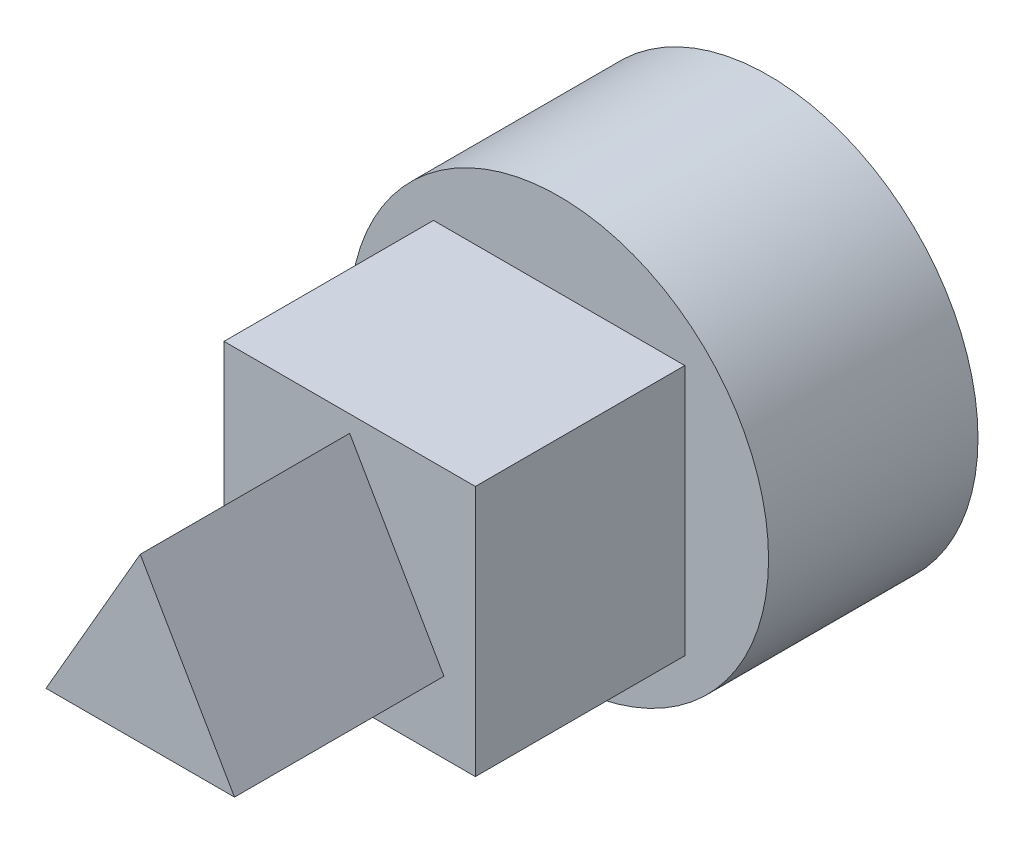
from build123d import *

# Parameters (mm, degrees)
DODANIE_WYCI_GNI_CIE1_DEPTH = 150
SZKIC1_3_W                  = 60
SZKIC1_3_H                  = 60
DODANIE_WYCI_GNI_CIE2_DEPTH = 100
SZKIC1_4_R                  = 50
SZKIC1_4_W                  = 60
SZKIC1_4_H                  = 60
DODANIE_WYCI_GNI_CIE3_DEPTH = 50


with BuildPart() as part:
    # Szkic1 → Dodanie-wyci_gni_cie1 (new body)
    with BuildSketch(Plane.XY):
        Polygon((-22.5, -12.990381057), (22.5, -12.990381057), (0, 25.980762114), align=None)
    extrude(amount=DODANIE_WYCI_GNI_CIE1_DEPTH)

    # Szkic1_3 → Dodanie-wyci_gni_cie2 (add)
    with BuildSketch(Plane.XY):
        Rectangle(SZKIC1_3_W, SZKIC1_3_H)
        Polygon((22.5, -12.990381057), (0, 25.980762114), (-22.5, -12.990381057), align=None, mode=Mode.SUBTRACT)
    extrude(amount=DODANIE_WYCI_GNI_CIE2_DEPTH)

    # Szkic1_4 → Dodanie-wyci_gni_cie3 (add)
    with BuildSketch(Plane.XY):
        Circle(SZKIC1_4_R)
        Rectangle(SZKIC1_4_W, SZKIC1_4_H, mode=Mode.SUBTRACT)
    extrude(amount=DODANIE_WYCI_GNI_CIE3_DEPTH)


solid = part.part
